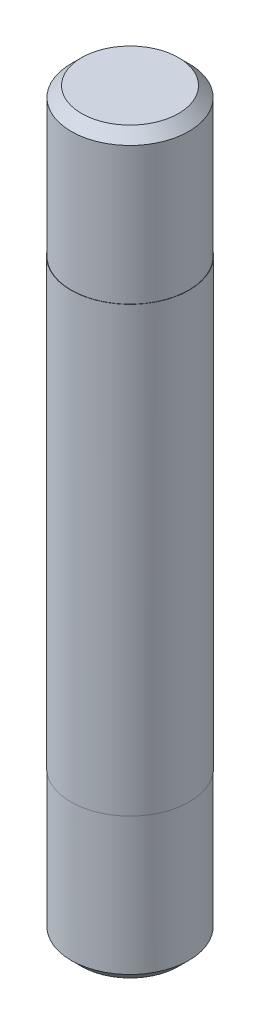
ISO-10303-21;
HEADER;
FILE_DESCRIPTION(('STEP AP214'),'2;1');
FILE_NAME('part.step','',(''),(''),'','','');
FILE_SCHEMA(('AUTOMOTIVE_DESIGN { 1 0 10303 214 1 1 1 1 }'));
ENDSEC;
DATA;
#1=APPLICATION_CONTEXT('core data for automotive mechanical design processes');
#2=APPLICATION_PROTOCOL_DEFINITION('international standard','automotive_design',2000,#1);
#3=PRODUCT_CONTEXT('',#1,'mechanical');
#4=PRODUCT('Part','Part','',(#3));
#5=PRODUCT_RELATED_PRODUCT_CATEGORY('part','',(#4));
#6=PRODUCT_DEFINITION_FORMATION('','',#4);
#7=PRODUCT_DEFINITION_CONTEXT('part definition',#1,'design');
#8=PRODUCT_DEFINITION('design','',#6,#7);
#9=PRODUCT_DEFINITION_SHAPE('','',#8);
#10=(LENGTH_UNIT() NAMED_UNIT(*) SI_UNIT(.MILLI.,.METRE.));
#11=(NAMED_UNIT(*) PLANE_ANGLE_UNIT() SI_UNIT($,.RADIAN.));
#12=(NAMED_UNIT(*) SI_UNIT($,.STERADIAN.) SOLID_ANGLE_UNIT());
#13=UNCERTAINTY_MEASURE_WITH_UNIT(LENGTH_MEASURE(1.E-05),#10,'distance_accuracy_value','');
#14=(GEOMETRIC_REPRESENTATION_CONTEXT(3) GLOBAL_UNCERTAINTY_ASSIGNED_CONTEXT((#13)) GLOBAL_UNIT_ASSIGNED_CONTEXT((#10,
#11,#12)) REPRESENTATION_CONTEXT('',''));
#15=CARTESIAN_POINT('',(0.,0.,0.));
#16=DIRECTION('',(0.,0.,1.));
#17=DIRECTION('',(1.,0.,0.));
#18=AXIS2_PLACEMENT_3D('',#15,#16,#17);
#19=CARTESIAN_POINT('',(0.,25.,0.));
#20=DIRECTION('',(0.,-1.,0.));
#21=DIRECTION('',(0.,0.,-1.));
#22=AXIS2_PLACEMENT_3D('',#19,#20,#21);
#23=CYLINDRICAL_SURFACE('',#22,2.);
#24=CARTESIAN_POINT('',(0.,20.,0.));
#25=DIRECTION('',(0.,1.,0.));
#26=DIRECTION('',(0.,0.,1.));
#27=AXIS2_PLACEMENT_3D('',#24,#25,#26);
#28=CIRCLE('',#27,2.);
#29=CARTESIAN_POINT('',(0.,20.,2.));
#30=VERTEX_POINT('',#29);
#31=EDGE_CURVE('E49',#30,#30,#28,.T.);
#32=ORIENTED_EDGE('',*,*,#31,.F.);
#33=EDGE_LOOP('',(#32));
#34=FACE_BOUND('',#33,.T.);
#35=CARTESIAN_POINT('',(0.,5.,0.));
#36=DIRECTION('',(0.,-1.,0.));
#37=DIRECTION('',(0.,0.,-1.));
#38=AXIS2_PLACEMENT_3D('',#35,#36,#37);
#39=CIRCLE('',#38,2.);
#40=CARTESIAN_POINT('',(0.,5.,-2.));
#41=VERTEX_POINT('',#40);
#42=EDGE_CURVE('E55',#41,#41,#39,.T.);
#43=ORIENTED_EDGE('',*,*,#42,.F.);
#44=EDGE_LOOP('',(#43));
#45=FACE_BOUND('',#44,.T.);
#46=ADVANCED_FACE('F30',(#34,#45),#23,.T.);
#47=CARTESIAN_POINT('',(0.,20.,0.));
#48=DIRECTION('',(0.,1.,0.));
#49=DIRECTION('',(0.,0.,1.));
#50=AXIS2_PLACEMENT_3D('',#47,#48,#49);
#51=PLANE('',#50);
#52=CARTESIAN_POINT('',(0.,20.,0.));
#53=DIRECTION('',(0.,1.,0.));
#54=DIRECTION('',(0.,0.,1.));
#55=AXIS2_PLACEMENT_3D('',#52,#53,#54);
#56=CIRCLE('',#55,1.99);
#57=CARTESIAN_POINT('',(0.,20.,1.99));
#58=VERTEX_POINT('',#57);
#59=EDGE_CURVE('E52',#58,#58,#56,.T.);
#60=ORIENTED_EDGE('',*,*,#59,.F.);
#61=EDGE_LOOP('',(#60));
#62=FACE_BOUND('',#61,.T.);
#63=ORIENTED_EDGE('',*,*,#31,.T.);
#64=EDGE_LOOP('',(#63));
#65=FACE_BOUND('',#64,.T.);
#66=ADVANCED_FACE('F72',(#62,#65),#51,.T.);
#67=CARTESIAN_POINT('',(0.,20.,0.));
#68=DIRECTION('',(0.,1.,0.));
#69=DIRECTION('',(0.,0.,1.));
#70=AXIS2_PLACEMENT_3D('',#67,#68,#69);
#71=CYLINDRICAL_SURFACE('',#70,1.99);
#72=CARTESIAN_POINT('',(0.,24.65,0.));
#73=DIRECTION('',(0.,1.,0.));
#74=DIRECTION('',(0.,0.,1.));
#75=AXIS2_PLACEMENT_3D('',#72,#73,#74);
#76=CIRCLE('',#75,1.99);
#77=CARTESIAN_POINT('',(0.,24.65,1.99));
#78=VERTEX_POINT('',#77);
#79=EDGE_CURVE('E10',#78,#78,#76,.F.);
#80=ORIENTED_EDGE('',*,*,#79,.T.);
#81=EDGE_LOOP('',(#80));
#82=FACE_BOUND('',#81,.T.);
#83=ORIENTED_EDGE('',*,*,#59,.T.);
#84=EDGE_LOOP('',(#83));
#85=FACE_BOUND('',#84,.T.);
#86=ADVANCED_FACE('F77',(#82,#85),#71,.T.);
#87=CARTESIAN_POINT('',(0.,25.,0.));
#88=DIRECTION('',(0.,1.,0.));
#89=DIRECTION('',(0.,0.,1.));
#90=AXIS2_PLACEMENT_3D('',#87,#88,#89);
#91=PLANE('',#90);
#92=CARTESIAN_POINT('',(0.,25.,0.));
#93=DIRECTION('',(0.,1.,0.));
#94=DIRECTION('',(0.,0.,1.));
#95=AXIS2_PLACEMENT_3D('',#92,#93,#94);
#96=CIRCLE('',#95,1.64);
#97=CARTESIAN_POINT('',(0.,25.,1.64));
#98=VERTEX_POINT('',#97);
#99=EDGE_CURVE('E36',#98,#98,#96,.T.);
#100=ORIENTED_EDGE('',*,*,#99,.T.);
#101=EDGE_LOOP('',(#100));
#102=FACE_BOUND('',#101,.T.);
#103=ADVANCED_FACE('F67',(#102),#91,.T.);
#104=CARTESIAN_POINT('',(0.,5.,0.));
#105=DIRECTION('',(0.,-1.,0.));
#106=DIRECTION('',(0.,0.,-1.));
#107=AXIS2_PLACEMENT_3D('',#104,#105,#106);
#108=PLANE('',#107);
#109=CARTESIAN_POINT('',(0.,5.,0.));
#110=DIRECTION('',(0.,-1.,0.));
#111=DIRECTION('',(0.,0.,-1.));
#112=AXIS2_PLACEMENT_3D('',#109,#110,#111);
#113=CIRCLE('',#112,1.99);
#114=CARTESIAN_POINT('',(0.,5.,-1.99));
#115=VERTEX_POINT('',#114);
#116=EDGE_CURVE('E58',#115,#115,#113,.T.);
#117=ORIENTED_EDGE('',*,*,#116,.F.);
#118=EDGE_LOOP('',(#117));
#119=FACE_BOUND('',#118,.T.);
#120=ORIENTED_EDGE('',*,*,#42,.T.);
#121=EDGE_LOOP('',(#120));
#122=FACE_BOUND('',#121,.T.);
#123=ADVANCED_FACE('F64',(#119,#122),#108,.T.);
#124=CARTESIAN_POINT('',(0.,5.,0.));
#125=DIRECTION('',(0.,-1.,0.));
#126=DIRECTION('',(0.,0.,-1.));
#127=AXIS2_PLACEMENT_3D('',#124,#125,#126);
#128=CYLINDRICAL_SURFACE('',#127,1.99);
#129=CARTESIAN_POINT('',(0.,0.350000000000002,0.));
#130=DIRECTION('',(0.,1.,0.));
#131=DIRECTION('',(0.,0.,1.));
#132=AXIS2_PLACEMENT_3D('',#129,#130,#131);
#133=CIRCLE('',#132,1.99);
#134=CARTESIAN_POINT('',(0.,0.350000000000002,1.99));
#135=VERTEX_POINT('',#134);
#136=EDGE_CURVE('E40',#135,#135,#133,.T.);
#137=ORIENTED_EDGE('',*,*,#136,.T.);
#138=EDGE_LOOP('',(#137));
#139=FACE_BOUND('',#138,.T.);
#140=ORIENTED_EDGE('',*,*,#116,.T.);
#141=EDGE_LOOP('',(#140));
#142=FACE_BOUND('',#141,.T.);
#143=ADVANCED_FACE('F62',(#139,#142),#128,.T.);
#144=CARTESIAN_POINT('',(0.,0.,0.));
#145=DIRECTION('',(0.,1.,0.));
#146=DIRECTION('',(0.,0.,1.));
#147=AXIS2_PLACEMENT_3D('',#144,#145,#146);
#148=PLANE('',#147);
#149=CARTESIAN_POINT('',(0.,0.,0.));
#150=DIRECTION('',(0.,1.,0.));
#151=DIRECTION('',(0.,0.,1.));
#152=AXIS2_PLACEMENT_3D('',#149,#150,#151);
#153=CIRCLE('',#152,1.64);
#154=CARTESIAN_POINT('',(0.,0.,1.64));
#155=VERTEX_POINT('',#154);
#156=EDGE_CURVE('E44',#155,#155,#153,.F.);
#157=ORIENTED_EDGE('',*,*,#156,.T.);
#158=EDGE_LOOP('',(#157));
#159=FACE_BOUND('',#158,.T.);
#160=ADVANCED_FACE('F88',(#159),#148,.F.);
#161=CARTESIAN_POINT('',(0.,0.,0.));
#162=DIRECTION('',(0.,1.,0.));
#163=DIRECTION('',(0.,0.,1.));
#164=AXIS2_PLACEMENT_3D('',#161,#162,#163);
#165=CONICAL_SURFACE('',#164,1.64,0.785398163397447);
#166=ORIENTED_EDGE('',*,*,#136,.F.);
#167=EDGE_LOOP('',(#166));
#168=FACE_BOUND('',#167,.T.);
#169=ORIENTED_EDGE('',*,*,#156,.F.);
#170=EDGE_LOOP('',(#169));
#171=FACE_BOUND('',#170,.T.);
#172=ADVANCED_FACE('F90',(#168,#171),#165,.T.);
#173=CARTESIAN_POINT('',(0.,25.,0.));
#174=DIRECTION('',(0.,-1.,0.));
#175=DIRECTION('',(0.,0.,-1.));
#176=AXIS2_PLACEMENT_3D('',#173,#174,#175);
#177=CONICAL_SURFACE('',#176,1.64,0.785398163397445);
#178=ORIENTED_EDGE('',*,*,#79,.F.);
#179=EDGE_LOOP('',(#178));
#180=FACE_BOUND('',#179,.T.);
#181=ORIENTED_EDGE('',*,*,#99,.F.);
#182=EDGE_LOOP('',(#181));
#183=FACE_BOUND('',#182,.T.);
#184=ADVANCED_FACE('F118',(#180,#183),#177,.T.);
#185=CLOSED_SHELL('',(#46,#66,#86,#103,#123,#143,#160,#172,#184));
#186=MANIFOLD_SOLID_BREP('B2',#185);
#187=ADVANCED_BREP_SHAPE_REPRESENTATION('',(#18,#186),#14);
#188=SHAPE_DEFINITION_REPRESENTATION(#9,#187);
ENDSEC;
END-ISO-10303-21;
